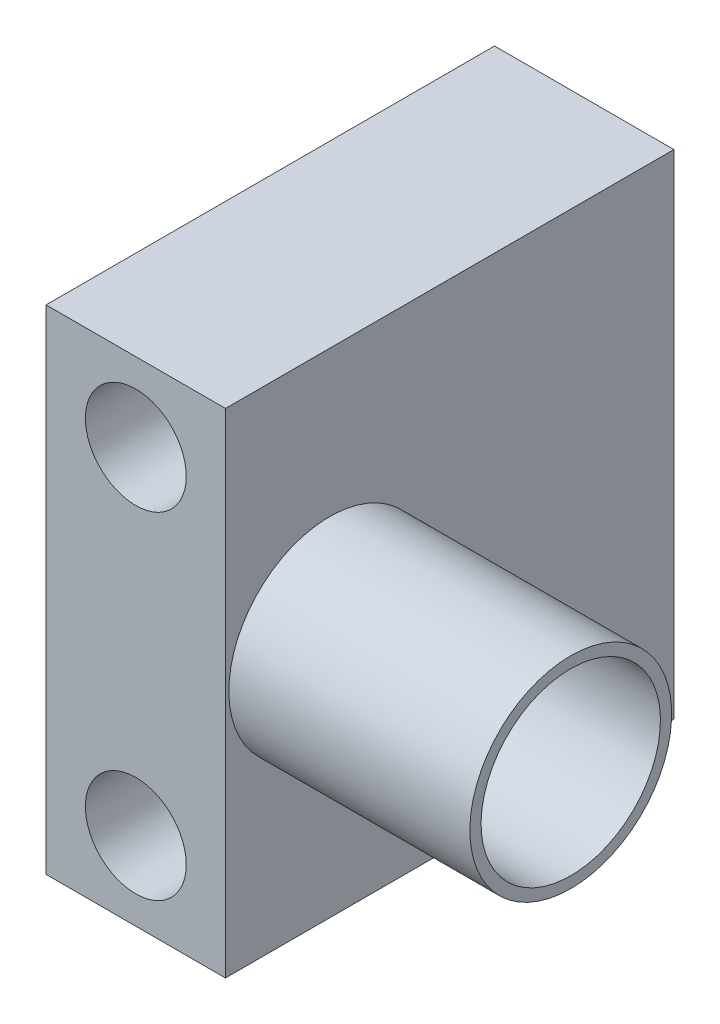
ISO-10303-21;
HEADER;
FILE_DESCRIPTION(('STEP AP214'),'2;1');
FILE_NAME('part.step','',(''),(''),'','','');
FILE_SCHEMA(('AUTOMOTIVE_DESIGN { 1 0 10303 214 1 1 1 1 }'));
ENDSEC;
DATA;
#1=APPLICATION_CONTEXT('core data for automotive mechanical design processes');
#2=APPLICATION_PROTOCOL_DEFINITION('international standard','automotive_design',2000,#1);
#3=PRODUCT_CONTEXT('',#1,'mechanical');
#4=PRODUCT('Part','Part','',(#3));
#5=PRODUCT_RELATED_PRODUCT_CATEGORY('part','',(#4));
#6=PRODUCT_DEFINITION_FORMATION('','',#4);
#7=PRODUCT_DEFINITION_CONTEXT('part definition',#1,'design');
#8=PRODUCT_DEFINITION('design','',#6,#7);
#9=PRODUCT_DEFINITION_SHAPE('','',#8);
#10=(LENGTH_UNIT() NAMED_UNIT(*) SI_UNIT(.MILLI.,.METRE.));
#11=(NAMED_UNIT(*) PLANE_ANGLE_UNIT() SI_UNIT($,.RADIAN.));
#12=(NAMED_UNIT(*) SI_UNIT($,.STERADIAN.) SOLID_ANGLE_UNIT());
#13=UNCERTAINTY_MEASURE_WITH_UNIT(LENGTH_MEASURE(1.E-05),#10,'distance_accuracy_value','');
#14=(GEOMETRIC_REPRESENTATION_CONTEXT(3) GLOBAL_UNCERTAINTY_ASSIGNED_CONTEXT((#13)) GLOBAL_UNIT_ASSIGNED_CONTEXT((#10,
#11,#12)) REPRESENTATION_CONTEXT('',''));
#15=CARTESIAN_POINT('',(0.,0.,0.));
#16=DIRECTION('',(0.,0.,1.));
#17=DIRECTION('',(1.,0.,0.));
#18=AXIS2_PLACEMENT_3D('',#15,#16,#17);
#19=CARTESIAN_POINT('',(8.,37.,40.));
#20=DIRECTION('',(-1.,0.,0.));
#21=DIRECTION('',(0.,-1.,0.));
#22=AXIS2_PLACEMENT_3D('',#19,#20,#21);
#23=PLANE('',#22);
#24=DIRECTION('',(0.,1.,0.));
#25=VECTOR('',#24,1.);
#26=CARTESIAN_POINT('',(8.,37.,0.));
#27=LINE('',#26,#25);
#28=CARTESIAN_POINT('',(8.,-7.,0.));
#29=VERTEX_POINT('',#28);
#30=CARTESIAN_POINT('',(8.,37.,0.));
#31=VERTEX_POINT('',#30);
#32=EDGE_CURVE('E62',#29,#31,#27,.T.);
#33=ORIENTED_EDGE('',*,*,#32,.T.);
#34=DIRECTION('',(0.,0.,-1.));
#35=VECTOR('',#34,1.);
#36=CARTESIAN_POINT('',(8.,37.,40.));
#37=LINE('',#36,#35);
#38=CARTESIAN_POINT('',(8.,37.,40.));
#39=VERTEX_POINT('',#38);
#40=EDGE_CURVE('E23',#39,#31,#37,.T.);
#41=ORIENTED_EDGE('',*,*,#40,.F.);
#42=DIRECTION('',(0.,1.,0.));
#43=VECTOR('',#42,1.);
#44=CARTESIAN_POINT('',(8.,37.,40.));
#45=LINE('',#44,#43);
#46=CARTESIAN_POINT('',(8.,-7.,40.));
#47=VERTEX_POINT('',#46);
#48=EDGE_CURVE('E88',#47,#39,#45,.T.);
#49=ORIENTED_EDGE('',*,*,#48,.F.);
#50=DIRECTION('',(0.,0.,-1.));
#51=VECTOR('',#50,1.);
#52=CARTESIAN_POINT('',(8.,-7.,40.));
#53=LINE('',#52,#51);
#54=EDGE_CURVE('E77',#47,#29,#53,.T.);
#55=ORIENTED_EDGE('',*,*,#54,.T.);
#56=EDGE_LOOP('',(#33,#41,#49,#55));
#57=FACE_BOUND('',#56,.T.);
#58=CARTESIAN_POINT('',(8.,15.,30.7));
#59=DIRECTION('',(-1.,0.,0.));
#60=DIRECTION('',(0.,-1.,0.));
#61=AXIS2_PLACEMENT_3D('',#58,#59,#60);
#62=CIRCLE('',#61,9.);
#63=CARTESIAN_POINT('',(8.,6.,30.7));
#64=VERTEX_POINT('',#63);
#65=EDGE_CURVE('E10',#64,#64,#62,.F.);
#66=ORIENTED_EDGE('',*,*,#65,.F.);
#67=EDGE_LOOP('',(#66));
#68=FACE_BOUND('',#67,.T.);
#69=ADVANCED_FACE('F15',(#57,#68),#23,.F.);
#70=CARTESIAN_POINT('',(8.,37.,40.));
#71=DIRECTION('',(0.,0.,-1.));
#72=DIRECTION('',(-1.,0.,0.));
#73=AXIS2_PLACEMENT_3D('',#70,#71,#72);
#74=PLANE('',#73);
#75=CARTESIAN_POINT('',(0.,30.,40.));
#76=DIRECTION('',(0.,0.,1.));
#77=DIRECTION('',(1.,0.,0.));
#78=AXIS2_PLACEMENT_3D('',#75,#76,#77);
#79=CIRCLE('',#78,4.5);
#80=CARTESIAN_POINT('',(4.5,30.,40.));
#81=VERTEX_POINT('',#80);
#82=EDGE_CURVE('E78',#81,#81,#79,.T.);
#83=ORIENTED_EDGE('',*,*,#82,.F.);
#84=EDGE_LOOP('',(#83));
#85=FACE_BOUND('',#84,.T.);
#86=ORIENTED_EDGE('',*,*,#48,.T.);
#87=DIRECTION('',(-1.,0.,0.));
#88=VECTOR('',#87,1.);
#89=CARTESIAN_POINT('',(8.,37.,40.));
#90=LINE('',#89,#88);
#91=CARTESIAN_POINT('',(-8.,37.,40.));
#92=VERTEX_POINT('',#91);
#93=EDGE_CURVE('E70',#39,#92,#90,.T.);
#94=ORIENTED_EDGE('',*,*,#93,.T.);
#95=DIRECTION('',(0.,-1.,0.));
#96=VECTOR('',#95,1.);
#97=CARTESIAN_POINT('',(-8.,37.,40.));
#98=LINE('',#97,#96);
#99=CARTESIAN_POINT('',(-8.,-7.,40.));
#100=VERTEX_POINT('',#99);
#101=EDGE_CURVE('E35',#92,#100,#98,.T.);
#102=ORIENTED_EDGE('',*,*,#101,.T.);
#103=DIRECTION('',(1.,0.,0.));
#104=VECTOR('',#103,1.);
#105=CARTESIAN_POINT('',(8.,-7.,40.));
#106=LINE('',#105,#104);
#107=EDGE_CURVE('E30',#100,#47,#106,.T.);
#108=ORIENTED_EDGE('',*,*,#107,.T.);
#109=EDGE_LOOP('',(#86,#94,#102,#108));
#110=FACE_BOUND('',#109,.T.);
#111=CARTESIAN_POINT('',(0.,0.,40.));
#112=DIRECTION('',(0.,0.,1.));
#113=DIRECTION('',(1.,0.,0.));
#114=AXIS2_PLACEMENT_3D('',#111,#112,#113);
#115=CIRCLE('',#114,4.5);
#116=CARTESIAN_POINT('',(4.5,0.,40.));
#117=VERTEX_POINT('',#116);
#118=EDGE_CURVE('E108',#117,#117,#115,.T.);
#119=ORIENTED_EDGE('',*,*,#118,.F.);
#120=EDGE_LOOP('',(#119));
#121=FACE_BOUND('',#120,.T.);
#122=ADVANCED_FACE('F101',(#85,#110,#121),#74,.F.);
#123=CARTESIAN_POINT('',(8.,37.,0.));
#124=DIRECTION('',(0.,0.,-1.));
#125=DIRECTION('',(-1.,0.,0.));
#126=AXIS2_PLACEMENT_3D('',#123,#124,#125);
#127=PLANE('',#126);
#128=CARTESIAN_POINT('',(0.,30.,0.));
#129=DIRECTION('',(0.,0.,1.));
#130=DIRECTION('',(1.,0.,0.));
#131=AXIS2_PLACEMENT_3D('',#128,#129,#130);
#132=CIRCLE('',#131,4.5);
#133=CARTESIAN_POINT('',(4.5,30.,0.));
#134=VERTEX_POINT('',#133);
#135=EDGE_CURVE('E81',#134,#134,#132,.T.);
#136=ORIENTED_EDGE('',*,*,#135,.T.);
#137=EDGE_LOOP('',(#136));
#138=FACE_BOUND('',#137,.T.);
#139=ORIENTED_EDGE('',*,*,#32,.F.);
#140=DIRECTION('',(1.,0.,0.));
#141=VECTOR('',#140,1.);
#142=CARTESIAN_POINT('',(8.,-7.,0.));
#143=LINE('',#142,#141);
#144=CARTESIAN_POINT('',(-8.,-7.,0.));
#145=VERTEX_POINT('',#144);
#146=EDGE_CURVE('E86',#145,#29,#143,.T.);
#147=ORIENTED_EDGE('',*,*,#146,.F.);
#148=DIRECTION('',(0.,-1.,0.));
#149=VECTOR('',#148,1.);
#150=CARTESIAN_POINT('',(-8.,37.,0.));
#151=LINE('',#150,#149);
#152=CARTESIAN_POINT('',(-8.,37.,0.));
#153=VERTEX_POINT('',#152);
#154=EDGE_CURVE('E63',#153,#145,#151,.T.);
#155=ORIENTED_EDGE('',*,*,#154,.F.);
#156=DIRECTION('',(-1.,0.,0.));
#157=VECTOR('',#156,1.);
#158=CARTESIAN_POINT('',(8.,37.,0.));
#159=LINE('',#158,#157);
#160=EDGE_CURVE('E56',#31,#153,#159,.T.);
#161=ORIENTED_EDGE('',*,*,#160,.F.);
#162=EDGE_LOOP('',(#139,#147,#155,#161));
#163=FACE_BOUND('',#162,.T.);
#164=CARTESIAN_POINT('',(0.,0.,0.));
#165=DIRECTION('',(0.,0.,1.));
#166=DIRECTION('',(1.,0.,0.));
#167=AXIS2_PLACEMENT_3D('',#164,#165,#166);
#168=CIRCLE('',#167,4.5);
#169=CARTESIAN_POINT('',(4.5,0.,0.));
#170=VERTEX_POINT('',#169);
#171=EDGE_CURVE('E110',#170,#170,#168,.T.);
#172=ORIENTED_EDGE('',*,*,#171,.T.);
#173=EDGE_LOOP('',(#172));
#174=FACE_BOUND('',#173,.T.);
#175=ADVANCED_FACE('F58',(#138,#163,#174),#127,.T.);
#176=CARTESIAN_POINT('',(8.,37.,40.));
#177=DIRECTION('',(0.,-1.,0.));
#178=DIRECTION('',(1.,0.,0.));
#179=AXIS2_PLACEMENT_3D('',#176,#177,#178);
#180=PLANE('',#179);
#181=ORIENTED_EDGE('',*,*,#160,.T.);
#182=DIRECTION('',(0.,0.,-1.));
#183=VECTOR('',#182,1.);
#184=CARTESIAN_POINT('',(-8.,37.,40.));
#185=LINE('',#184,#183);
#186=EDGE_CURVE('E73',#92,#153,#185,.T.);
#187=ORIENTED_EDGE('',*,*,#186,.F.);
#188=ORIENTED_EDGE('',*,*,#93,.F.);
#189=ORIENTED_EDGE('',*,*,#40,.T.);
#190=EDGE_LOOP('',(#181,#187,#188,#189));
#191=FACE_BOUND('',#190,.T.);
#192=ADVANCED_FACE('F69',(#191),#180,.F.);
#193=CARTESIAN_POINT('',(-8.,37.,40.));
#194=DIRECTION('',(1.,0.,0.));
#195=DIRECTION('',(0.,1.,0.));
#196=AXIS2_PLACEMENT_3D('',#193,#194,#195);
#197=PLANE('',#196);
#198=CARTESIAN_POINT('',(-8.,15.,30.7));
#199=DIRECTION('',(-1.,0.,0.));
#200=DIRECTION('',(0.,-1.,0.));
#201=AXIS2_PLACEMENT_3D('',#198,#199,#200);
#202=CIRCLE('',#201,5.25);
#203=CARTESIAN_POINT('',(-8.,9.75,30.7));
#204=VERTEX_POINT('',#203);
#205=EDGE_CURVE('E119',#204,#204,#202,.T.);
#206=ORIENTED_EDGE('',*,*,#205,.F.);
#207=EDGE_LOOP('',(#206));
#208=FACE_BOUND('',#207,.T.);
#209=ORIENTED_EDGE('',*,*,#154,.T.);
#210=DIRECTION('',(0.,0.,-1.));
#211=VECTOR('',#210,1.);
#212=CARTESIAN_POINT('',(-8.,-7.,40.));
#213=LINE('',#212,#211);
#214=EDGE_CURVE('E94',#100,#145,#213,.T.);
#215=ORIENTED_EDGE('',*,*,#214,.F.);
#216=ORIENTED_EDGE('',*,*,#101,.F.);
#217=ORIENTED_EDGE('',*,*,#186,.T.);
#218=EDGE_LOOP('',(#209,#215,#216,#217));
#219=FACE_BOUND('',#218,.T.);
#220=ADVANCED_FACE('F98',(#208,#219),#197,.F.);
#221=CARTESIAN_POINT('',(8.,-7.,40.));
#222=DIRECTION('',(0.,1.,0.));
#223=DIRECTION('',(0.,0.,1.));
#224=AXIS2_PLACEMENT_3D('',#221,#222,#223);
#225=PLANE('',#224);
#226=ORIENTED_EDGE('',*,*,#146,.T.);
#227=ORIENTED_EDGE('',*,*,#54,.F.);
#228=ORIENTED_EDGE('',*,*,#107,.F.);
#229=ORIENTED_EDGE('',*,*,#214,.T.);
#230=EDGE_LOOP('',(#226,#227,#228,#229));
#231=FACE_BOUND('',#230,.T.);
#232=ADVANCED_FACE('F100',(#231),#225,.F.);
#233=CARTESIAN_POINT('',(0.,30.,40.));
#234=DIRECTION('',(0.,0.,-1.));
#235=DIRECTION('',(-1.,0.,0.));
#236=AXIS2_PLACEMENT_3D('',#233,#234,#235);
#237=CYLINDRICAL_SURFACE('',#236,4.5);
#238=ORIENTED_EDGE('',*,*,#82,.T.);
#239=EDGE_LOOP('',(#238));
#240=FACE_BOUND('',#239,.T.);
#241=ORIENTED_EDGE('',*,*,#135,.F.);
#242=EDGE_LOOP('',(#241));
#243=FACE_BOUND('',#242,.T.);
#244=ADVANCED_FACE('F189',(#240,#243),#237,.F.);
#245=CARTESIAN_POINT('',(0.,0.,40.));
#246=DIRECTION('',(0.,0.,-1.));
#247=DIRECTION('',(-1.,0.,0.));
#248=AXIS2_PLACEMENT_3D('',#245,#246,#247);
#249=CYLINDRICAL_SURFACE('',#248,4.5);
#250=ORIENTED_EDGE('',*,*,#118,.T.);
#251=EDGE_LOOP('',(#250));
#252=FACE_BOUND('',#251,.T.);
#253=ORIENTED_EDGE('',*,*,#171,.F.);
#254=EDGE_LOOP('',(#253));
#255=FACE_BOUND('',#254,.T.);
#256=ADVANCED_FACE('F142',(#252,#255),#249,.F.);
#257=CARTESIAN_POINT('',(29.5,15.,30.7));
#258=DIRECTION('',(-1.,0.,0.));
#259=DIRECTION('',(0.,-1.,0.));
#260=AXIS2_PLACEMENT_3D('',#257,#258,#259);
#261=CYLINDRICAL_SURFACE('',#260,9.);
#262=CARTESIAN_POINT('',(29.5,15.,30.7));
#263=DIRECTION('',(1.,0.,0.));
#264=DIRECTION('',(0.,1.,0.));
#265=AXIS2_PLACEMENT_3D('',#262,#263,#264);
#266=CIRCLE('',#265,9.);
#267=CARTESIAN_POINT('',(29.5,24.,30.7));
#268=VERTEX_POINT('',#267);
#269=EDGE_CURVE('E114',#268,#268,#266,.T.);
#270=ORIENTED_EDGE('',*,*,#269,.F.);
#271=EDGE_LOOP('',(#270));
#272=FACE_BOUND('',#271,.T.);
#273=ORIENTED_EDGE('',*,*,#65,.T.);
#274=EDGE_LOOP('',(#273));
#275=FACE_BOUND('',#274,.T.);
#276=ADVANCED_FACE('F136',(#272,#275),#261,.T.);
#277=CARTESIAN_POINT('',(29.5,15.,30.7));
#278=DIRECTION('',(1.,0.,0.));
#279=DIRECTION('',(0.,1.,0.));
#280=AXIS2_PLACEMENT_3D('',#277,#278,#279);
#281=PLANE('',#280);
#282=CARTESIAN_POINT('',(29.5,15.,30.7));
#283=DIRECTION('',(1.,0.,0.));
#284=DIRECTION('',(0.,1.,0.));
#285=AXIS2_PLACEMENT_3D('',#282,#283,#284);
#286=CIRCLE('',#285,8.);
#287=CARTESIAN_POINT('',(29.5,23.,30.7));
#288=VERTEX_POINT('',#287);
#289=EDGE_CURVE('E125',#288,#288,#286,.T.);
#290=ORIENTED_EDGE('',*,*,#289,.F.);
#291=EDGE_LOOP('',(#290));
#292=FACE_BOUND('',#291,.T.);
#293=ORIENTED_EDGE('',*,*,#269,.T.);
#294=EDGE_LOOP('',(#293));
#295=FACE_BOUND('',#294,.T.);
#296=ADVANCED_FACE('F132',(#292,#295),#281,.T.);
#297=CARTESIAN_POINT('',(29.5,15.,30.7));
#298=DIRECTION('',(-1.,0.,0.));
#299=DIRECTION('',(0.,-1.,0.));
#300=AXIS2_PLACEMENT_3D('',#297,#298,#299);
#301=CYLINDRICAL_SURFACE('',#300,5.25);
#302=CARTESIAN_POINT('',(9.,15.,30.7));
#303=DIRECTION('',(-1.,0.,0.));
#304=DIRECTION('',(0.,-1.,0.));
#305=AXIS2_PLACEMENT_3D('',#302,#303,#304);
#306=CIRCLE('',#305,5.25);
#307=CARTESIAN_POINT('',(9.,9.75,30.7));
#308=VERTEX_POINT('',#307);
#309=EDGE_CURVE('E18',#308,#308,#306,.F.);
#310=ORIENTED_EDGE('',*,*,#309,.T.);
#311=EDGE_LOOP('',(#310));
#312=FACE_BOUND('',#311,.T.);
#313=ORIENTED_EDGE('',*,*,#205,.T.);
#314=EDGE_LOOP('',(#313));
#315=FACE_BOUND('',#314,.T.);
#316=ADVANCED_FACE('F135',(#312,#315),#301,.F.);
#317=CARTESIAN_POINT('',(9.,37.,40.));
#318=DIRECTION('',(-1.,0.,0.));
#319=DIRECTION('',(0.,-1.,0.));
#320=AXIS2_PLACEMENT_3D('',#317,#318,#319);
#321=PLANE('',#320);
#322=CARTESIAN_POINT('',(9.,15.,30.7));
#323=DIRECTION('',(-1.,0.,0.));
#324=DIRECTION('',(0.,-1.,0.));
#325=AXIS2_PLACEMENT_3D('',#322,#323,#324);
#326=CIRCLE('',#325,8.);
#327=CARTESIAN_POINT('',(9.,7.,30.7));
#328=VERTEX_POINT('',#327);
#329=EDGE_CURVE('E122',#328,#328,#326,.F.);
#330=ORIENTED_EDGE('',*,*,#329,.T.);
#331=EDGE_LOOP('',(#330));
#332=FACE_BOUND('',#331,.T.);
#333=ORIENTED_EDGE('',*,*,#309,.F.);
#334=EDGE_LOOP('',(#333));
#335=FACE_BOUND('',#334,.T.);
#336=ADVANCED_FACE('F220',(#332,#335),#321,.F.);
#337=CARTESIAN_POINT('',(-14.6274169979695,15.,30.7));
#338=DIRECTION('',(1.,0.,0.));
#339=DIRECTION('',(0.,1.,0.));
#340=AXIS2_PLACEMENT_3D('',#337,#338,#339);
#341=CYLINDRICAL_SURFACE('',#340,8.);
#342=ORIENTED_EDGE('',*,*,#289,.T.);
#343=EDGE_LOOP('',(#342));
#344=FACE_BOUND('',#343,.T.);
#345=ORIENTED_EDGE('',*,*,#329,.F.);
#346=EDGE_LOOP('',(#345));
#347=FACE_BOUND('',#346,.T.);
#348=ADVANCED_FACE('F129',(#344,#347),#341,.F.);
#349=CLOSED_SHELL('',(#69,#122,#175,#192,#220,#232,#244,#256,#276,#296,#316,#336,#348));
#350=MANIFOLD_SOLID_BREP('B1',#349);
#351=ADVANCED_BREP_SHAPE_REPRESENTATION('',(#18,#350),#14);
#352=SHAPE_DEFINITION_REPRESENTATION(#9,#351);
ENDSEC;
END-ISO-10303-21;
